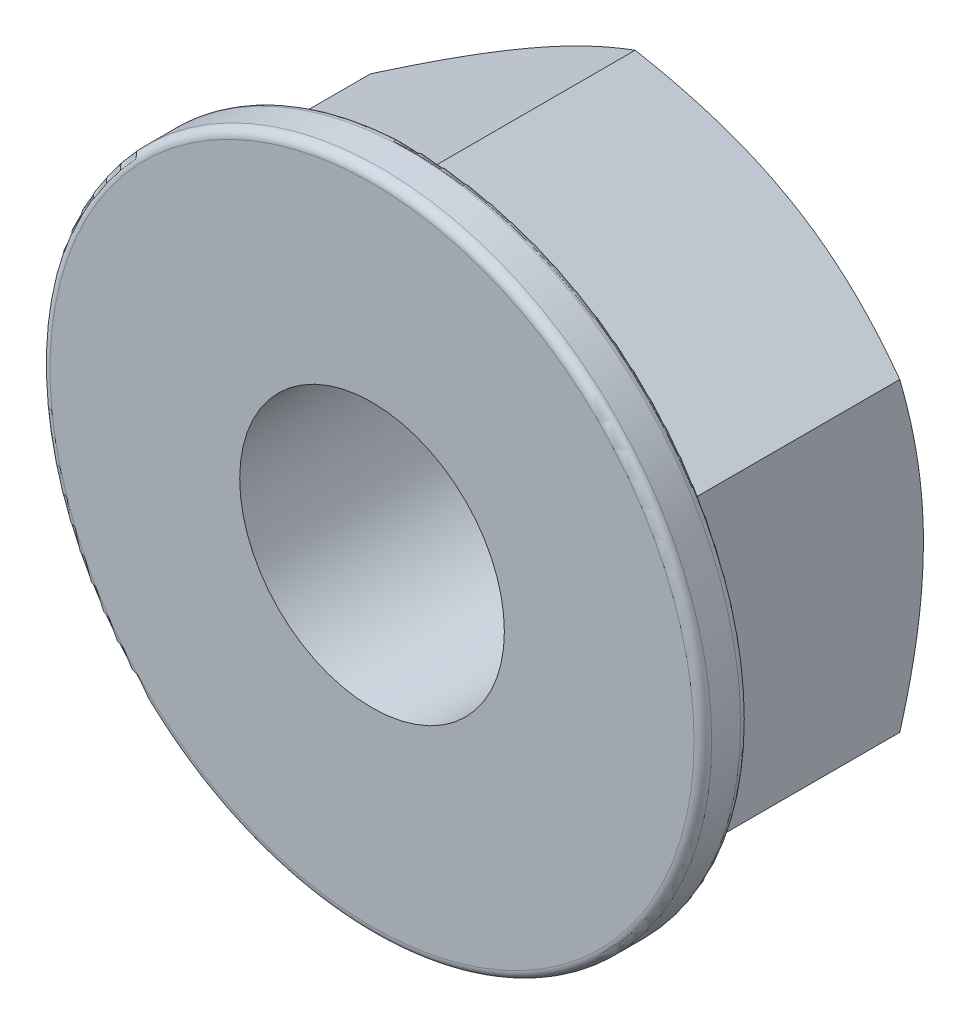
ISO-10303-21;
HEADER;
FILE_DESCRIPTION(('STEP AP214'),'2;1');
FILE_NAME('part.step','',(''),(''),'','','');
FILE_SCHEMA(('AUTOMOTIVE_DESIGN { 1 0 10303 214 1 1 1 1 }'));
ENDSEC;
DATA;
#1=APPLICATION_CONTEXT('core data for automotive mechanical design processes');
#2=APPLICATION_PROTOCOL_DEFINITION('international standard','automotive_design',2000,#1);
#3=PRODUCT_CONTEXT('',#1,'mechanical');
#4=PRODUCT('Part','Part','',(#3));
#5=PRODUCT_RELATED_PRODUCT_CATEGORY('part','',(#4));
#6=PRODUCT_DEFINITION_FORMATION('','',#4);
#7=PRODUCT_DEFINITION_CONTEXT('part definition',#1,'design');
#8=PRODUCT_DEFINITION('design','',#6,#7);
#9=PRODUCT_DEFINITION_SHAPE('','',#8);
#10=(LENGTH_UNIT() NAMED_UNIT(*) SI_UNIT(.MILLI.,.METRE.));
#11=(NAMED_UNIT(*) PLANE_ANGLE_UNIT() SI_UNIT($,.RADIAN.));
#12=(NAMED_UNIT(*) SI_UNIT($,.STERADIAN.) SOLID_ANGLE_UNIT());
#13=UNCERTAINTY_MEASURE_WITH_UNIT(LENGTH_MEASURE(1.E-05),#10,'distance_accuracy_value','');
#14=(GEOMETRIC_REPRESENTATION_CONTEXT(3) GLOBAL_UNCERTAINTY_ASSIGNED_CONTEXT((#13)) GLOBAL_UNIT_ASSIGNED_CONTEXT((#10,
#11,#12)) REPRESENTATION_CONTEXT('',''));
#15=CARTESIAN_POINT('',(0.,0.,0.));
#16=DIRECTION('',(0.,0.,1.));
#17=DIRECTION('',(1.,0.,0.));
#18=AXIS2_PLACEMENT_3D('',#15,#16,#17);
#19=CARTESIAN_POINT('',(3.,1.73205080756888,-3.25));
#20=DIRECTION('',(0.499999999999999,0.866025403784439,0.));
#21=DIRECTION('',(-0.866025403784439,0.5,0.));
#22=AXIS2_PLACEMENT_3D('',#19,#20,#21);
#23=PLANE('',#22);
#24=DIRECTION('',(0.,0.,1.));
#25=VECTOR('',#24,1.);
#26=CARTESIAN_POINT('',(0.,3.46410161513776,-3.25));
#27=LINE('',#26,#25);
#28=CARTESIAN_POINT('',(0.,3.46410161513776,-2.98205080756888));
#29=VERTEX_POINT('',#28);
#30=CARTESIAN_POINT('',(0.,3.46410161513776,-0.595299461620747));
#31=VERTEX_POINT('',#30);
#32=EDGE_CURVE('E125',#29,#31,#27,.T.);
#33=ORIENTED_EDGE('',*,*,#32,.T.);
#34=CARTESIAN_POINT('',(-0.0002,3.4642170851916,-0.595260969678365));
#35=CARTESIAN_POINT('',(0.124174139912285,3.39240964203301,-0.619207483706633));
#36=CARTESIAN_POINT('',(0.248894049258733,3.32040256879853,-0.640975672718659));
#37=CARTESIAN_POINT('',(0.499014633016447,3.17599538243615,-0.679254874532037));
#38=CARTESIAN_POINT('',(0.624415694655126,3.10359504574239,-0.695762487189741));
#39=CARTESIAN_POINT('',(0.874727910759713,2.95907722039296,-0.722480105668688));
#40=CARTESIAN_POINT('',(0.999635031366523,2.88696206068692,-0.732739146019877));
#41=CARTESIAN_POINT('',(1.24969482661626,2.74258997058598,-0.746498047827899));
#42=CARTESIAN_POINT('',(1.37484741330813,2.67033309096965,-0.749999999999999));
#43=CARTESIAN_POINT('',(1.62515258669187,2.52581933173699,-0.749999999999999));
#44=CARTESIAN_POINT('',(1.75030517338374,2.45356245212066,-0.746498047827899));
#45=CARTESIAN_POINT('',(2.00036496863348,2.30919036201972,-0.732739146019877));
#46=CARTESIAN_POINT('',(2.12527208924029,2.23707520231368,-0.722480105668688));
#47=CARTESIAN_POINT('',(2.37558430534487,2.09255737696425,-0.695762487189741));
#48=CARTESIAN_POINT('',(2.50098536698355,2.02015704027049,-0.679254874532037));
#49=CARTESIAN_POINT('',(2.75110595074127,1.87574985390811,-0.640975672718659));
#50=CARTESIAN_POINT('',(2.87582586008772,1.80374278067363,-0.619207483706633));
#51=CARTESIAN_POINT('',(3.0002,1.73193533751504,-0.595260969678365));
#52=B_SPLINE_CURVE_WITH_KNOTS('',3,(#34,#35,#36,#37,#38,#39,#40,#41,#42,#43,#44,#45,#46,#47,#48,
#49,#50,#51),.UNSPECIFIED.,.F.,.F.,(4,2,2,2,2,2,2,2,4),(0.,0.43682988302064,0.873941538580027,
1.30757729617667,1.74107886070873,2.17458042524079,2.60821618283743,3.04532783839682,
3.48215772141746),.UNSPECIFIED.);
#53=CARTESIAN_POINT('',(3.,1.73205080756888,-0.595299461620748));
#54=VERTEX_POINT('',#53);
#55=EDGE_CURVE('E45',#31,#54,#52,.T.);
#56=ORIENTED_EDGE('',*,*,#55,.T.);
#57=DIRECTION('',(0.,0.,1.));
#58=VECTOR('',#57,1.);
#59=CARTESIAN_POINT('',(3.,1.73205080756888,-3.25));
#60=LINE('',#59,#58);
#61=CARTESIAN_POINT('',(3.,1.73205080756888,-2.98205080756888));
#62=VERTEX_POINT('',#61);
#63=EDGE_CURVE('E140',#62,#54,#60,.T.);
#64=ORIENTED_EDGE('',*,*,#63,.F.);
#65=CARTESIAN_POINT('',(-0.0002,3.4642170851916,-2.98198413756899));
#66=CARTESIAN_POINT('',(0.131635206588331,3.38810199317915,-3.02594629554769));
#67=CARTESIAN_POINT('',(0.264608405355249,3.31132988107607,-3.06592841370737));
#68=CARTESIAN_POINT('',(0.532857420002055,3.15645624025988,-3.13571791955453));
#69=CARTESIAN_POINT('',(0.668138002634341,3.078351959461,-3.16550061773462));
#70=CARTESIAN_POINT('',(0.937022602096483,2.92311136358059,-3.21186216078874));
#71=CARTESIAN_POINT('',(1.07058524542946,2.84599893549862,-3.22874955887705));
#72=CARTESIAN_POINT('',(1.33833905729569,2.6914112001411,-3.24891035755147));
#73=CARTESIAN_POINT('',(1.47252925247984,2.61393645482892,-3.25220045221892));
#74=CARTESIAN_POINT('',(1.72327559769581,2.46916798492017,-3.24535946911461));
#75=CARTESIAN_POINT('',(1.83986926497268,2.40185259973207,-3.23690808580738));
#76=CARTESIAN_POINT('',(2.07229698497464,2.2676603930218,-3.21012105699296));
#77=CARTESIAN_POINT('',(2.18813023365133,2.2007840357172,-3.19177625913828));
#78=CARTESIAN_POINT('',(2.42103725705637,2.06631510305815,-3.14591524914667));
#79=CARTESIAN_POINT('',(2.53808155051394,1.99873954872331,-3.11820461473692));
#80=CARTESIAN_POINT('',(2.77042435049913,1.8645963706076,-3.0553122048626));
#81=CARTESIAN_POINT('',(2.88572583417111,1.79802702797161,-3.02014520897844));
#82=CARTESIAN_POINT('',(3.0002,1.73193533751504,-2.98198413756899));
#83=B_SPLINE_CURVE_WITH_KNOTS('',3,(#65,#66,#67,#68,#69,#70,#71,#72,#73,#74,#75,#76,#77,#78,#79,
#80,#81,#82),.UNSPECIFIED.,.F.,.F.,(4,2,2,2,2,2,2,2,4),(0.,0.47553983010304,0.952222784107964,
1.41710776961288,1.88142182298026,2.28572436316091,2.69040156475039,3.10405572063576,
3.5168974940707),.UNSPECIFIED.);
#84=CARTESIAN_POINT('',(1.5,2.59807621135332,-3.25));
#85=VERTEX_POINT('',#84);
#86=EDGE_CURVE('E153',#85,#62,#83,.T.);
#87=ORIENTED_EDGE('',*,*,#86,.F.);
#88=EDGE_CURVE('E129',#29,#85,#83,.T.);
#89=ORIENTED_EDGE('',*,*,#88,.F.);
#90=EDGE_LOOP('',(#33,#56,#64,#87,#89));
#91=FACE_BOUND('',#90,.T.);
#92=ADVANCED_FACE('F26',(#91),#23,.T.);
#93=CARTESIAN_POINT('',(3.,-1.73205080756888,-3.25));
#94=DIRECTION('',(1.,0.,0.));
#95=DIRECTION('',(0.,0.,-1.));
#96=AXIS2_PLACEMENT_3D('',#93,#94,#95);
#97=PLANE('',#96);
#98=ORIENTED_EDGE('',*,*,#63,.T.);
#99=CARTESIAN_POINT('',(3.,-4.59020119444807,0.0778690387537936));
#100=CARTESIAN_POINT('',(3.,-4.45420228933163,0.0399323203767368));
#101=CARTESIAN_POINT('',(3.,-4.31807581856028,0.00244462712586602));
#102=CARTESIAN_POINT('',(3.,-4.04550363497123,-0.0713861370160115));
#103=CARTESIAN_POINT('',(3.,-3.90905790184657,-0.107729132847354));
#104=CARTESIAN_POINT('',(3.,-3.63559336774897,-0.179073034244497));
#105=CARTESIAN_POINT('',(3.,-3.49857401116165,-0.214071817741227));
#106=CARTESIAN_POINT('',(3.,-3.22410320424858,-0.282330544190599));
#107=CARTESIAN_POINT('',(3.,-3.08665175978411,-0.315590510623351));
#108=CARTESIAN_POINT('',(3.,-2.81286518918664,-0.379566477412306));
#109=CARTESIAN_POINT('',(3.,-2.67653602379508,-0.410307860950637));
#110=CARTESIAN_POINT('',(3.,-2.40331140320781,-0.469156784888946));
#111=CARTESIAN_POINT('',(3.,-2.26641596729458,-0.497264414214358));
#112=CARTESIAN_POINT('',(3.,-1.99201717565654,-0.550202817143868));
#113=CARTESIAN_POINT('',(3.,-1.85451395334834,-0.575034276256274));
#114=CARTESIAN_POINT('',(3.,-1.57883140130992,-0.620673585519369));
#115=CARTESIAN_POINT('',(3.,-1.4406520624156,-0.641481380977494));
#116=CARTESIAN_POINT('',(3.,-1.16736289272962,-0.677750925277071));
#117=CARTESIAN_POINT('',(3.,-1.03227036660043,-0.69334131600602));
#118=CARTESIAN_POINT('',(3.,-0.761584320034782,-0.719185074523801));
#119=CARTESIAN_POINT('',(3.,-0.625990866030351,-0.729439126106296));
#120=CARTESIAN_POINT('',(3.,-0.354569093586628,-0.74402859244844));
#121=CARTESIAN_POINT('',(3.,-0.218740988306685,-0.748367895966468));
#122=CARTESIAN_POINT('',(3.,0.0529727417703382,-0.750868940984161));
#123=CARTESIAN_POINT('',(3.,0.188858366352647,-0.749030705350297));
#124=CARTESIAN_POINT('',(3.,0.461110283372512,-0.739268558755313));
#125=CARTESIAN_POINT('',(3.,0.597475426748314,-0.731313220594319));
#126=CARTESIAN_POINT('',(3.,0.869754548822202,-0.709755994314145));
#127=CARTESIAN_POINT('',(3.,1.0056685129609,-0.696153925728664));
#128=CARTESIAN_POINT('',(3.,1.27703363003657,-0.663993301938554));
#129=CARTESIAN_POINT('',(3.,1.4124842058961,-0.645429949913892));
#130=CARTESIAN_POINT('',(3.,1.68273907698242,-0.604127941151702));
#131=CARTESIAN_POINT('',(3.,1.81754336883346,-0.581389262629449));
#132=CARTESIAN_POINT('',(3.,2.21204103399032,-0.509685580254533));
#133=CARTESIAN_POINT('',(3.,2.47088128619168,-0.456048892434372));
#134=CARTESIAN_POINT('',(3.,2.98667363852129,-0.340354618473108));
#135=CARTESIAN_POINT('',(3.,3.24362531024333,-0.278295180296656));
#136=CARTESIAN_POINT('',(3.,3.75623603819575,-0.148558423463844));
#137=CARTESIAN_POINT('',(3.,4.01189435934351,-0.0808782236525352));
#138=CARTESIAN_POINT('',(3.,4.5221438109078,0.0582624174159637));
#139=CARTESIAN_POINT('',(3.,4.7767350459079,0.129722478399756));
#140=CARTESIAN_POINT('',(3.,5.28177573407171,0.274315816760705));
#141=CARTESIAN_POINT('',(3.,5.53223522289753,0.347414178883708));
#142=CARTESIAN_POINT('',(3.,6.03261138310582,0.495468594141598));
#143=CARTESIAN_POINT('',(3.,6.28252803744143,0.570424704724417));
#144=CARTESIAN_POINT('',(3.,6.78140909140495,0.721541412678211));
#145=CARTESIAN_POINT('',(3.,7.03037438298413,0.797699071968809));
#146=CARTESIAN_POINT('',(3.,7.52796786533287,0.951060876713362));
#147=CARTESIAN_POINT('',(3.,7.77659607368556,1.02826496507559));
#148=CARTESIAN_POINT('',(3.,8.02510735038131,1.10583900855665));
#149=B_SPLINE_CURVE_WITH_KNOTS('',3,(#99,#100,#101,#102,#103,#104,#105,#106,#107,#108,#109,#110,
#111,#112,#113,#114,#115,#116,#117,#118,#119,#120,#121,#122,#123,#124,#125,#126,#127,#128,#129,
#130,#131,#132,#133,#134,#135,#136,#137,#138,#139,#140,#141,#142,#143,#144,#145,#146,#147,#148),
.UNSPECIFIED.,.F.,.F.,(4,2,2,2,2,2,2,2,2,2,2,2,2,2,2,2,2,2,2,2,2,2,2,2,4),(0.,0.42357554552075,
0.847178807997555,1.27142540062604,1.69566626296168,2.11490216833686,2.53412391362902,
2.9532578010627,3.37239738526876,3.78027302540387,4.188096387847,4.59565148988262,
5.00320508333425,5.41286662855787,5.82254126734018,6.23261344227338,6.64268775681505,
7.43545521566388,8.22839727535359,9.02174832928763,9.81501971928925,10.5977359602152,
11.3804764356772,12.1615330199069,12.9425471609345),.UNSPECIFIED.);
#150=CARTESIAN_POINT('',(3.,-1.73205080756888,-0.595299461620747));
#151=VERTEX_POINT('',#150);
#152=EDGE_CURVE('E172',#54,#151,#149,.F.);
#153=ORIENTED_EDGE('',*,*,#152,.T.);
#154=DIRECTION('',(0.,0.,1.));
#155=VECTOR('',#154,1.);
#156=CARTESIAN_POINT('',(3.,-1.73205080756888,-3.25));
#157=LINE('',#156,#155);
#158=CARTESIAN_POINT('',(3.,-1.73205080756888,-2.98205080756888));
#159=VERTEX_POINT('',#158);
#160=EDGE_CURVE('E145',#159,#151,#157,.T.);
#161=ORIENTED_EDGE('',*,*,#160,.F.);
#162=CARTESIAN_POINT('',(3.,-4.66961520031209,-1.77761086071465));
#163=CARTESIAN_POINT('',(3.,-4.53839997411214,-1.84133063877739));
#164=CARTESIAN_POINT('',(3.,-4.40688527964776,-1.90444421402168));
#165=CARTESIAN_POINT('',(3.,-4.14309768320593,-2.02911821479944));
#166=CARTESIAN_POINT('',(3.,-4.01082466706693,-2.09067839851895));
#167=CARTESIAN_POINT('',(3.,-3.74468832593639,-2.21221069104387));
#168=CARTESIAN_POINT('',(3.,-3.61082027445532,-2.27217248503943));
#169=CARTESIAN_POINT('',(3.,-3.3420249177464,-2.38966369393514));
#170=CARTESIAN_POINT('',(3.,-3.20709766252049,-2.44719322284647));
#171=CARTESIAN_POINT('',(3.,-2.93163396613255,-2.56096864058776));
#172=CARTESIAN_POINT('',(3.,-2.79105608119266,-2.6171147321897));
#173=CARTESIAN_POINT('',(3.,-2.50826222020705,-2.72519882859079));
#174=CARTESIAN_POINT('',(3.,-2.36604606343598,-2.77713636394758));
#175=CARTESIAN_POINT('',(3.,-2.08000969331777,-2.87545307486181));
#176=CARTESIAN_POINT('',(3.,-1.936193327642,-2.92184333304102));
#177=CARTESIAN_POINT('',(3.,-1.64649812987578,-3.00758861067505));
#178=CARTESIAN_POINT('',(3.,-1.50061995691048,-3.04694582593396));
#179=CARTESIAN_POINT('',(3.,-1.20748793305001,-3.11654848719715));
#180=CARTESIAN_POINT('',(3.,-1.06024555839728,-3.14684137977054));
#181=CARTESIAN_POINT('',(3.,-0.763912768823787,-3.19659944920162));
#182=CARTESIAN_POINT('',(3.,-0.614822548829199,-3.21606575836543));
#183=CARTESIAN_POINT('',(3.,-0.317492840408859,-3.24236390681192));
#184=CARTESIAN_POINT('',(3.,-0.16926820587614,-3.24935954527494));
#185=CARTESIAN_POINT('',(3.,0.12724792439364,-3.25055550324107));
#186=CARTESIAN_POINT('',(3.,0.275539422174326,-3.2447554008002));
#187=CARTESIAN_POINT('',(3.,0.526718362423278,-3.22450560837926));
#188=CARTESIAN_POINT('',(3.,0.629872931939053,-3.21317498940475));
#189=CARTESIAN_POINT('',(3.,0.835434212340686,-3.1850174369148));
#190=CARTESIAN_POINT('',(3.,0.937840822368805,-3.1681897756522));
#191=CARTESIAN_POINT('',(3.,1.24379191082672,-3.11034516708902));
#192=CARTESIAN_POINT('',(3.,1.44596225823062,-3.06197622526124));
#193=CARTESIAN_POINT('',(3.,1.74842393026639,-2.97797843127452));
#194=CARTESIAN_POINT('',(3.,1.85027756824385,-2.94765443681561));
#195=CARTESIAN_POINT('',(3.,2.05299487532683,-2.8838315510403));
#196=CARTESIAN_POINT('',(3.,2.15385853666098,-2.85033263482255));
#197=CARTESIAN_POINT('',(3.,2.3546297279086,-2.78069976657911));
#198=CARTESIAN_POINT('',(3.,2.45453753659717,-2.74456661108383));
#199=CARTESIAN_POINT('',(3.,2.65352144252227,-2.67009304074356));
#200=CARTESIAN_POINT('',(3.,2.75259756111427,-2.63175268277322));
#201=CARTESIAN_POINT('',(3.,3.02983879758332,-2.52148714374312));
#202=CARTESIAN_POINT('',(3.,3.20717304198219,-2.4474745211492));
#203=CARTESIAN_POINT('',(3.,3.55995594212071,-2.29506810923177));
#204=CARTESIAN_POINT('',(3.,3.73540436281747,-2.21667378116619));
#205=CARTESIAN_POINT('',(3.,4.08486964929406,-2.05659644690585));
#206=CARTESIAN_POINT('',(3.,4.25888594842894,-1.97491220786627));
#207=CARTESIAN_POINT('',(3.,4.60573898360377,-1.80907141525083));
#208=CARTESIAN_POINT('',(3.,4.77857568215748,-1.72491478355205));
#209=CARTESIAN_POINT('',(3.,5.12358964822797,-1.55455574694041));
#210=CARTESIAN_POINT('',(3.,5.29576536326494,-1.46835020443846));
#211=CARTESIAN_POINT('',(3.,5.63935614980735,-1.2944348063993));
#212=CARTESIAN_POINT('',(3.,5.81077121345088,-1.20672493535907));
#213=CARTESIAN_POINT('',(3.,6.32401410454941,-0.941858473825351));
#214=CARTESIAN_POINT('',(3.,6.66492352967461,-0.76292320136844));
#215=CARTESIAN_POINT('',(3.,7.3069721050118,-0.422157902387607));
#216=CARTESIAN_POINT('',(3.,7.60828723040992,-0.26065786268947));
#217=CARTESIAN_POINT('',(3.,8.209970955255,0.0641436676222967));
#218=CARTESIAN_POINT('',(3.,8.51033948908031,0.227445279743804));
#219=CARTESIAN_POINT('',(3.,9.10932825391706,0.554812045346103));
#220=CARTESIAN_POINT('',(3.,9.40795095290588,0.718872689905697));
#221=CARTESIAN_POINT('',(3.,10.0046079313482,1.04800238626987));
#222=CARTESIAN_POINT('',(3.,10.3026422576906,1.21307135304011));
#223=CARTESIAN_POINT('',(3.,10.6004726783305,1.37850527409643));
#224=B_SPLINE_CURVE_WITH_KNOTS('',3,(#162,#163,#164,#165,#166,#167,#168,#169,#170,#171,#172,
#173,#174,#175,#176,#177,#178,#179,#180,#181,#182,#183,#184,#185,#186,#187,#188,#189,#190,#191,
#192,#193,#194,#195,#196,#197,#198,#199,#200,#201,#202,#203,#204,#205,#206,#207,#208,#209,#210,
#211,#212,#213,#214,#215,#216,#217,#218,#219,#220,#221,#222,#223),.UNSPECIFIED.,.F.,.F.,(4,2,2,
2,2,2,2,2,2,2,2,2,2,2,2,2,2,2,2,2,2,2,2,2,2,2,2,2,2,2,4),(0.,0.437611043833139,
0.875289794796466,1.31532114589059,1.75533184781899,2.20940609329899,2.66353091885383,
3.1167327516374,3.56979284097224,4.02043817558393,4.47103637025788,4.91567120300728,
5.36032069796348,5.67149523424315,5.9827109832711,6.60545852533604,6.92424658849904,
7.24303715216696,7.56173171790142,7.88041807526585,8.4568056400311,9.03326422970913,
9.60994088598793,10.1866357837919,10.7642793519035,11.3419288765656,12.4969467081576,
13.5225417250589,14.5482063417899,15.5703699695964,16.5924485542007),.UNSPECIFIED.);
#225=CARTESIAN_POINT('',(3.,0.,-3.25));
#226=VERTEX_POINT('',#225);
#227=EDGE_CURVE('E217',#226,#159,#224,.F.);
#228=ORIENTED_EDGE('',*,*,#227,.F.);
#229=EDGE_CURVE('E222',#62,#226,#224,.F.);
#230=ORIENTED_EDGE('',*,*,#229,.F.);
#231=EDGE_LOOP('',(#98,#153,#161,#228,#230));
#232=FACE_BOUND('',#231,.T.);
#233=ADVANCED_FACE('F209',(#232),#97,.T.);
#234=CARTESIAN_POINT('',(3.,-1.73205080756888,-3.25));
#235=DIRECTION('',(0.499999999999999,-0.866025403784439,0.));
#236=DIRECTION('',(0.866025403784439,0.5,0.));
#237=AXIS2_PLACEMENT_3D('',#234,#235,#236);
#238=PLANE('',#237);
#239=ORIENTED_EDGE('',*,*,#160,.T.);
#240=CARTESIAN_POINT('',(3.0002,-1.73193533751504,-0.595260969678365));
#241=CARTESIAN_POINT('',(2.87582586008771,-1.80374278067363,-0.619207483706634));
#242=CARTESIAN_POINT('',(2.75110595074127,-1.87574985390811,-0.640975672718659));
#243=CARTESIAN_POINT('',(2.50098536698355,-2.02015704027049,-0.679254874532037));
#244=CARTESIAN_POINT('',(2.37558430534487,-2.09255737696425,-0.695762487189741));
#245=CARTESIAN_POINT('',(2.12527208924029,-2.23707520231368,-0.722480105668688));
#246=CARTESIAN_POINT('',(2.00036496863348,-2.30919036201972,-0.732739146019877));
#247=CARTESIAN_POINT('',(1.75030517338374,-2.45356245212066,-0.746498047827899));
#248=CARTESIAN_POINT('',(1.62515258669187,-2.52581933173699,-0.749999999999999));
#249=CARTESIAN_POINT('',(1.37484741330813,-2.67033309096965,-0.749999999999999));
#250=CARTESIAN_POINT('',(1.24969482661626,-2.74258997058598,-0.746498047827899));
#251=CARTESIAN_POINT('',(0.999635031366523,-2.88696206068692,-0.732739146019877));
#252=CARTESIAN_POINT('',(0.874727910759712,-2.95907722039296,-0.722480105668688));
#253=CARTESIAN_POINT('',(0.624415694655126,-3.10359504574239,-0.695762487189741));
#254=CARTESIAN_POINT('',(0.499014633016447,-3.17599538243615,-0.679254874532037));
#255=CARTESIAN_POINT('',(0.248894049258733,-3.32040256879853,-0.640975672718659));
#256=CARTESIAN_POINT('',(0.124174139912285,-3.39240964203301,-0.619207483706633));
#257=CARTESIAN_POINT('',(-0.00020000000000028,-3.4642170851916,-0.595260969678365));
#258=B_SPLINE_CURVE_WITH_KNOTS('',3,(#240,#241,#242,#243,#244,#245,#246,#247,#248,#249,#250,
#251,#252,#253,#254,#255,#256,#257),.UNSPECIFIED.,.F.,.F.,(4,2,2,2,2,2,2,2,4),(0.,
0.43682988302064,0.873941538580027,1.30757729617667,1.74107886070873,2.17458042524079,
2.60821618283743,3.04532783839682,3.48215772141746),.UNSPECIFIED.);
#259=CARTESIAN_POINT('',(0.,-3.46410161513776,-0.595299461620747));
#260=VERTEX_POINT('',#259);
#261=EDGE_CURVE('E170',#151,#260,#258,.T.);
#262=ORIENTED_EDGE('',*,*,#261,.T.);
#263=DIRECTION('',(0.,0.,1.));
#264=VECTOR('',#263,1.);
#265=CARTESIAN_POINT('',(0.,-3.46410161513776,-3.25));
#266=LINE('',#265,#264);
#267=CARTESIAN_POINT('',(0.,-3.46410161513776,-2.98205080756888));
#268=VERTEX_POINT('',#267);
#269=EDGE_CURVE('E127',#268,#260,#266,.T.);
#270=ORIENTED_EDGE('',*,*,#269,.F.);
#271=CARTESIAN_POINT('',(3.0002,-1.73193533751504,-2.98198413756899));
#272=CARTESIAN_POINT('',(2.86836479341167,-1.80805042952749,-3.02594629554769));
#273=CARTESIAN_POINT('',(2.73539159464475,-1.88482254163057,-3.06592841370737));
#274=CARTESIAN_POINT('',(2.46714257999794,-2.03969618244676,-3.13571791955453));
#275=CARTESIAN_POINT('',(2.33186199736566,-2.11780046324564,-3.16550061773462));
#276=CARTESIAN_POINT('',(2.06297739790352,-2.27304105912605,-3.21186216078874));
#277=CARTESIAN_POINT('',(1.92941475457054,-2.35015348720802,-3.22874955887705));
#278=CARTESIAN_POINT('',(1.66166094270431,-2.50474122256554,-3.24891035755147));
#279=CARTESIAN_POINT('',(1.52747074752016,-2.58221596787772,-3.25220045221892));
#280=CARTESIAN_POINT('',(1.27672440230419,-2.72698443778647,-3.24535946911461));
#281=CARTESIAN_POINT('',(1.16013073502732,-2.79429982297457,-3.23690808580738));
#282=CARTESIAN_POINT('',(0.927703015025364,-2.92849202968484,-3.21012105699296));
#283=CARTESIAN_POINT('',(0.811869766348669,-2.99536838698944,-3.19177625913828));
#284=CARTESIAN_POINT('',(0.578962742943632,-3.12983731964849,-3.14591524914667));
#285=CARTESIAN_POINT('',(0.461918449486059,-3.19741287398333,-3.11820461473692));
#286=CARTESIAN_POINT('',(0.229575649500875,-3.33155605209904,-3.0553122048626));
#287=CARTESIAN_POINT('',(0.114274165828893,-3.39812539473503,-3.02014520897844));
#288=CARTESIAN_POINT('',(-0.000200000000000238,-3.4642170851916,-2.98198413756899));
#289=B_SPLINE_CURVE_WITH_KNOTS('',3,(#271,#272,#273,#274,#275,#276,#277,#278,#279,#280,#281,
#282,#283,#284,#285,#286,#287,#288),.UNSPECIFIED.,.F.,.F.,(4,2,2,2,2,2,2,2,4),(0.,
0.47553983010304,0.952222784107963,1.41710776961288,1.88142182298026,2.28572436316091,
2.69040156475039,3.10405572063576,3.5168974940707),.UNSPECIFIED.);
#290=CARTESIAN_POINT('',(1.5,-2.59807621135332,-3.25));
#291=VERTEX_POINT('',#290);
#292=EDGE_CURVE('E168',#291,#268,#289,.T.);
#293=ORIENTED_EDGE('',*,*,#292,.F.);
#294=EDGE_CURVE('E223',#159,#291,#289,.T.);
#295=ORIENTED_EDGE('',*,*,#294,.F.);
#296=EDGE_LOOP('',(#239,#262,#270,#293,#295));
#297=FACE_BOUND('',#296,.T.);
#298=ADVANCED_FACE('F166',(#297),#238,.T.);
#299=CARTESIAN_POINT('',(-3.,-1.73205080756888,-3.25));
#300=DIRECTION('',(-0.499999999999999,-0.866025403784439,0.));
#301=DIRECTION('',(0.866025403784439,-0.5,0.));
#302=AXIS2_PLACEMENT_3D('',#299,#300,#301);
#303=PLANE('',#302);
#304=ORIENTED_EDGE('',*,*,#269,.T.);
#305=CARTESIAN_POINT('',(0.0002,-3.4642170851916,-0.595260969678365));
#306=CARTESIAN_POINT('',(-0.124174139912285,-3.39240964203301,-0.619207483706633));
#307=CARTESIAN_POINT('',(-0.248894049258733,-3.32040256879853,-0.640975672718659));
#308=CARTESIAN_POINT('',(-0.499014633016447,-3.17599538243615,-0.679254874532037));
#309=CARTESIAN_POINT('',(-0.624415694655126,-3.10359504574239,-0.695762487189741));
#310=CARTESIAN_POINT('',(-0.874727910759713,-2.95907722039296,-0.722480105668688));
#311=CARTESIAN_POINT('',(-0.999635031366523,-2.88696206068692,-0.732739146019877));
#312=CARTESIAN_POINT('',(-1.24969482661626,-2.74258997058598,-0.746498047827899));
#313=CARTESIAN_POINT('',(-1.37484741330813,-2.67033309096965,-0.749999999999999));
#314=CARTESIAN_POINT('',(-1.62515258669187,-2.52581933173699,-0.749999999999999));
#315=CARTESIAN_POINT('',(-1.75030517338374,-2.45356245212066,-0.746498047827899));
#316=CARTESIAN_POINT('',(-2.00036496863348,-2.30919036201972,-0.732739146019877));
#317=CARTESIAN_POINT('',(-2.12527208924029,-2.23707520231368,-0.722480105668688));
#318=CARTESIAN_POINT('',(-2.37558430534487,-2.09255737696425,-0.695762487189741));
#319=CARTESIAN_POINT('',(-2.50098536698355,-2.02015704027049,-0.679254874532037));
#320=CARTESIAN_POINT('',(-2.75110595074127,-1.87574985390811,-0.640975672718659));
#321=CARTESIAN_POINT('',(-2.87582586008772,-1.80374278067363,-0.619207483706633));
#322=CARTESIAN_POINT('',(-3.0002,-1.73193533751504,-0.595260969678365));
#323=B_SPLINE_CURVE_WITH_KNOTS('',3,(#305,#306,#307,#308,#309,#310,#311,#312,#313,#314,#315,
#316,#317,#318,#319,#320,#321,#322),.UNSPECIFIED.,.F.,.F.,(4,2,2,2,2,2,2,2,4),(0.,
0.43682988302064,0.873941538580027,1.30757729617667,1.74107886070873,2.17458042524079,
2.60821618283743,3.04532783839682,3.48215772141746),.UNSPECIFIED.);
#324=CARTESIAN_POINT('',(-3.,-1.73205080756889,-0.595299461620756));
#325=VERTEX_POINT('',#324);
#326=EDGE_CURVE('E112',#260,#325,#323,.T.);
#327=ORIENTED_EDGE('',*,*,#326,.T.);
#328=DIRECTION('',(0.,0.,1.));
#329=VECTOR('',#328,1.);
#330=CARTESIAN_POINT('',(-3.,-1.73205080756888,-3.25));
#331=LINE('',#330,#329);
#332=CARTESIAN_POINT('',(-3.,-1.73205080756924,-2.98205080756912));
#333=VERTEX_POINT('',#332);
#334=EDGE_CURVE('E110',#333,#325,#331,.T.);
#335=ORIENTED_EDGE('',*,*,#334,.F.);
#336=CARTESIAN_POINT('',(0.0002,-3.4642170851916,-2.98198413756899));
#337=CARTESIAN_POINT('',(-0.131635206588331,-3.38810199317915,-3.02594629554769));
#338=CARTESIAN_POINT('',(-0.264608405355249,-3.31132988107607,-3.06592841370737));
#339=CARTESIAN_POINT('',(-0.532857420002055,-3.15645624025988,-3.13571791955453));
#340=CARTESIAN_POINT('',(-0.668138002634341,-3.078351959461,-3.16550061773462));
#341=CARTESIAN_POINT('',(-0.937022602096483,-2.92311136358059,-3.21186216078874));
#342=CARTESIAN_POINT('',(-1.07058524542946,-2.84599893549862,-3.22874955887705));
#343=CARTESIAN_POINT('',(-1.33833905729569,-2.6914112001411,-3.24891035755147));
#344=CARTESIAN_POINT('',(-1.47252925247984,-2.61393645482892,-3.25220045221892));
#345=CARTESIAN_POINT('',(-1.72327559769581,-2.46916798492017,-3.24535946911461));
#346=CARTESIAN_POINT('',(-1.83986926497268,-2.40185259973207,-3.23690808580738));
#347=CARTESIAN_POINT('',(-2.07229698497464,-2.2676603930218,-3.21012105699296));
#348=CARTESIAN_POINT('',(-2.18813023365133,-2.2007840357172,-3.19177625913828));
#349=CARTESIAN_POINT('',(-2.42103725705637,-2.06631510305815,-3.14591524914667));
#350=CARTESIAN_POINT('',(-2.53808155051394,-1.99873954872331,-3.11820461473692));
#351=CARTESIAN_POINT('',(-2.77042435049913,-1.8645963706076,-3.0553122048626));
#352=CARTESIAN_POINT('',(-2.88572583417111,-1.79802702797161,-3.02014520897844));
#353=CARTESIAN_POINT('',(-3.0002,-1.73193533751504,-2.98198413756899));
#354=B_SPLINE_CURVE_WITH_KNOTS('',3,(#336,#337,#338,#339,#340,#341,#342,#343,#344,#345,#346,
#347,#348,#349,#350,#351,#352,#353),.UNSPECIFIED.,.F.,.F.,(4,2,2,2,2,2,2,2,4),(0.,
0.47553983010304,0.952222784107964,1.41710776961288,1.88142182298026,2.28572436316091,
2.69040156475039,3.10405572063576,3.5168974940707),.UNSPECIFIED.);
#355=CARTESIAN_POINT('',(-1.5,-2.59807621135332,-3.25));
#356=VERTEX_POINT('',#355);
#357=EDGE_CURVE('E254',#356,#333,#354,.T.);
#358=ORIENTED_EDGE('',*,*,#357,.F.);
#359=EDGE_CURVE('E52',#268,#356,#354,.T.);
#360=ORIENTED_EDGE('',*,*,#359,.F.);
#361=EDGE_LOOP('',(#304,#327,#335,#358,#360));
#362=FACE_BOUND('',#361,.T.);
#363=ADVANCED_FACE('F162',(#362),#303,.T.);
#364=CARTESIAN_POINT('',(-3.,-1.73205080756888,-3.25));
#365=DIRECTION('',(-1.,0.,0.));
#366=DIRECTION('',(0.,0.,1.));
#367=AXIS2_PLACEMENT_3D('',#364,#365,#366);
#368=PLANE('',#367);
#369=ORIENTED_EDGE('',*,*,#334,.T.);
#370=CARTESIAN_POINT('',(-3.,-4.59020119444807,0.0778690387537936));
#371=CARTESIAN_POINT('',(-3.,-4.45420228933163,0.0399323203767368));
#372=CARTESIAN_POINT('',(-3.,-4.31807581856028,0.00244462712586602));
#373=CARTESIAN_POINT('',(-3.,-4.04550363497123,-0.0713861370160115));
#374=CARTESIAN_POINT('',(-3.,-3.90905790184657,-0.107729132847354));
#375=CARTESIAN_POINT('',(-3.,-3.63559336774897,-0.179073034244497));
#376=CARTESIAN_POINT('',(-3.,-3.49857401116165,-0.214071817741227));
#377=CARTESIAN_POINT('',(-3.,-3.22410320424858,-0.282330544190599));
#378=CARTESIAN_POINT('',(-3.,-3.08665175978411,-0.315590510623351));
#379=CARTESIAN_POINT('',(-3.,-2.81286518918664,-0.379566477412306));
#380=CARTESIAN_POINT('',(-3.,-2.67653602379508,-0.410307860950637));
#381=CARTESIAN_POINT('',(-3.,-2.40331140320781,-0.469156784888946));
#382=CARTESIAN_POINT('',(-3.,-2.26641596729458,-0.497264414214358));
#383=CARTESIAN_POINT('',(-3.,-1.99201717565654,-0.550202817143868));
#384=CARTESIAN_POINT('',(-3.,-1.85451395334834,-0.575034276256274));
#385=CARTESIAN_POINT('',(-3.,-1.57883140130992,-0.620673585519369));
#386=CARTESIAN_POINT('',(-3.,-1.4406520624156,-0.641481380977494));
#387=CARTESIAN_POINT('',(-3.,-1.16736289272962,-0.677750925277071));
#388=CARTESIAN_POINT('',(-3.,-1.03227036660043,-0.69334131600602));
#389=CARTESIAN_POINT('',(-3.,-0.761584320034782,-0.719185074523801));
#390=CARTESIAN_POINT('',(-3.,-0.625990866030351,-0.729439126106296));
#391=CARTESIAN_POINT('',(-3.,-0.354569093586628,-0.74402859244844));
#392=CARTESIAN_POINT('',(-3.,-0.218740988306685,-0.748367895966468));
#393=CARTESIAN_POINT('',(-3.,0.0529727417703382,-0.750868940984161));
#394=CARTESIAN_POINT('',(-3.,0.188858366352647,-0.749030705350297));
#395=CARTESIAN_POINT('',(-3.,0.461110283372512,-0.739268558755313));
#396=CARTESIAN_POINT('',(-3.,0.597475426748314,-0.731313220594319));
#397=CARTESIAN_POINT('',(-3.,0.869754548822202,-0.709755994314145));
#398=CARTESIAN_POINT('',(-3.,1.0056685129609,-0.696153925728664));
#399=CARTESIAN_POINT('',(-3.,1.27703363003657,-0.663993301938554));
#400=CARTESIAN_POINT('',(-3.,1.4124842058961,-0.645429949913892));
#401=CARTESIAN_POINT('',(-3.,1.68273907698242,-0.604127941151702));
#402=CARTESIAN_POINT('',(-3.,1.81754336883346,-0.581389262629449));
#403=CARTESIAN_POINT('',(-3.,2.21204103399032,-0.509685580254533));
#404=CARTESIAN_POINT('',(-3.,2.47088128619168,-0.456048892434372));
#405=CARTESIAN_POINT('',(-3.,2.98667363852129,-0.340354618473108));
#406=CARTESIAN_POINT('',(-3.,3.24362531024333,-0.278295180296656));
#407=CARTESIAN_POINT('',(-3.,3.75623603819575,-0.148558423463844));
#408=CARTESIAN_POINT('',(-3.,4.01189435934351,-0.0808782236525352));
#409=CARTESIAN_POINT('',(-3.,4.5221438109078,0.0582624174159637));
#410=CARTESIAN_POINT('',(-3.,4.7767350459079,0.129722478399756));
#411=CARTESIAN_POINT('',(-3.,5.28177573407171,0.274315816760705));
#412=CARTESIAN_POINT('',(-3.,5.53223522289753,0.347414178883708));
#413=CARTESIAN_POINT('',(-3.,6.03261138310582,0.495468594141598));
#414=CARTESIAN_POINT('',(-3.,6.28252803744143,0.570424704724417));
#415=CARTESIAN_POINT('',(-3.,6.78140909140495,0.721541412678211));
#416=CARTESIAN_POINT('',(-3.,7.03037438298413,0.797699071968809));
#417=CARTESIAN_POINT('',(-3.,7.52796786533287,0.951060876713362));
#418=CARTESIAN_POINT('',(-3.,7.77659607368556,1.02826496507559));
#419=CARTESIAN_POINT('',(-3.,8.02510735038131,1.10583900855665));
#420=B_SPLINE_CURVE_WITH_KNOTS('',3,(#370,#371,#372,#373,#374,#375,#376,#377,#378,#379,#380,
#381,#382,#383,#384,#385,#386,#387,#388,#389,#390,#391,#392,#393,#394,#395,#396,#397,#398,#399,
#400,#401,#402,#403,#404,#405,#406,#407,#408,#409,#410,#411,#412,#413,#414,#415,#416,#417,#418,
#419),.UNSPECIFIED.,.F.,.F.,(4,2,2,2,2,2,2,2,2,2,2,2,2,2,2,2,2,2,2,2,2,2,2,2,4),(0.,
0.42357554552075,0.847178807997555,1.27142540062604,1.69566626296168,2.11490216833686,
2.53412391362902,2.9532578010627,3.37239738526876,3.78027302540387,4.188096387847,
4.59565148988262,5.00320508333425,5.41286662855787,5.82254126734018,6.23261344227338,
6.64268775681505,7.43545521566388,8.22839727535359,9.02174832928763,9.81501971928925,
10.5977359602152,11.3804764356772,12.1615330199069,12.9425471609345),.UNSPECIFIED.);
#421=CARTESIAN_POINT('',(-3.,1.73205080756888,-0.595299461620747));
#422=VERTEX_POINT('',#421);
#423=EDGE_CURVE('E103',#325,#422,#420,.T.);
#424=ORIENTED_EDGE('',*,*,#423,.T.);
#425=DIRECTION('',(0.,0.,1.));
#426=VECTOR('',#425,1.);
#427=CARTESIAN_POINT('',(-3.,1.73205080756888,-3.25));
#428=LINE('',#427,#426);
#429=CARTESIAN_POINT('',(-3.,1.73205080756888,-2.98205080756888));
#430=VERTEX_POINT('',#429);
#431=EDGE_CURVE('E107',#430,#422,#428,.T.);
#432=ORIENTED_EDGE('',*,*,#431,.F.);
#433=CARTESIAN_POINT('',(-3.,-4.66961520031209,-1.77761086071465));
#434=CARTESIAN_POINT('',(-3.,-4.53839997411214,-1.84133063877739));
#435=CARTESIAN_POINT('',(-3.,-4.40688527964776,-1.90444421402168));
#436=CARTESIAN_POINT('',(-3.,-4.14309768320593,-2.02911821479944));
#437=CARTESIAN_POINT('',(-3.,-4.01082466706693,-2.09067839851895));
#438=CARTESIAN_POINT('',(-3.,-3.74468832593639,-2.21221069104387));
#439=CARTESIAN_POINT('',(-3.,-3.61082027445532,-2.27217248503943));
#440=CARTESIAN_POINT('',(-3.,-3.3420249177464,-2.38966369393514));
#441=CARTESIAN_POINT('',(-3.,-3.20709766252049,-2.44719322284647));
#442=CARTESIAN_POINT('',(-3.,-2.93163396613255,-2.56096864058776));
#443=CARTESIAN_POINT('',(-3.,-2.79105608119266,-2.6171147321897));
#444=CARTESIAN_POINT('',(-3.,-2.50826222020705,-2.72519882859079));
#445=CARTESIAN_POINT('',(-3.,-2.36604606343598,-2.77713636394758));
#446=CARTESIAN_POINT('',(-3.,-2.08000969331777,-2.87545307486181));
#447=CARTESIAN_POINT('',(-3.,-1.936193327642,-2.92184333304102));
#448=CARTESIAN_POINT('',(-3.,-1.64649812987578,-3.00758861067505));
#449=CARTESIAN_POINT('',(-3.,-1.50061995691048,-3.04694582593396));
#450=CARTESIAN_POINT('',(-3.,-1.20748793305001,-3.11654848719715));
#451=CARTESIAN_POINT('',(-3.,-1.06024555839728,-3.14684137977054));
#452=CARTESIAN_POINT('',(-3.,-0.763912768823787,-3.19659944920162));
#453=CARTESIAN_POINT('',(-3.,-0.614822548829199,-3.21606575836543));
#454=CARTESIAN_POINT('',(-3.,-0.317492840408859,-3.24236390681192));
#455=CARTESIAN_POINT('',(-3.,-0.16926820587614,-3.24935954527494));
#456=CARTESIAN_POINT('',(-3.,0.12724792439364,-3.25055550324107));
#457=CARTESIAN_POINT('',(-3.,0.275539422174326,-3.2447554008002));
#458=CARTESIAN_POINT('',(-3.,0.526718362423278,-3.22450560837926));
#459=CARTESIAN_POINT('',(-3.,0.629872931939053,-3.21317498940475));
#460=CARTESIAN_POINT('',(-3.,0.835434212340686,-3.1850174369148));
#461=CARTESIAN_POINT('',(-3.,0.937840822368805,-3.1681897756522));
#462=CARTESIAN_POINT('',(-3.,1.24379191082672,-3.11034516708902));
#463=CARTESIAN_POINT('',(-3.,1.44596225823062,-3.06197622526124));
#464=CARTESIAN_POINT('',(-3.,1.74842393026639,-2.97797843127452));
#465=CARTESIAN_POINT('',(-3.,1.85027756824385,-2.94765443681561));
#466=CARTESIAN_POINT('',(-3.,2.05299487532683,-2.8838315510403));
#467=CARTESIAN_POINT('',(-3.,2.15385853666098,-2.85033263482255));
#468=CARTESIAN_POINT('',(-3.,2.3546297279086,-2.78069976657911));
#469=CARTESIAN_POINT('',(-3.,2.45453753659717,-2.74456661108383));
#470=CARTESIAN_POINT('',(-3.,2.65352144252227,-2.67009304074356));
#471=CARTESIAN_POINT('',(-3.,2.75259756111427,-2.63175268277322));
#472=CARTESIAN_POINT('',(-3.,3.02983879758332,-2.52148714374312));
#473=CARTESIAN_POINT('',(-3.,3.20717304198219,-2.4474745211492));
#474=CARTESIAN_POINT('',(-3.,3.55995594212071,-2.29506810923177));
#475=CARTESIAN_POINT('',(-3.,3.73540436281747,-2.21667378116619));
#476=CARTESIAN_POINT('',(-3.,4.08486964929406,-2.05659644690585));
#477=CARTESIAN_POINT('',(-3.,4.25888594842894,-1.97491220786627));
#478=CARTESIAN_POINT('',(-3.,4.60573898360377,-1.80907141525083));
#479=CARTESIAN_POINT('',(-3.,4.77857568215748,-1.72491478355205));
#480=CARTESIAN_POINT('',(-3.,5.12358964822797,-1.55455574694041));
#481=CARTESIAN_POINT('',(-3.,5.29576536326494,-1.46835020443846));
#482=CARTESIAN_POINT('',(-3.,5.63935614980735,-1.2944348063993));
#483=CARTESIAN_POINT('',(-3.,5.81077121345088,-1.20672493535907));
#484=CARTESIAN_POINT('',(-3.,6.32401410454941,-0.941858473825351));
#485=CARTESIAN_POINT('',(-3.,6.66492352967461,-0.76292320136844));
#486=CARTESIAN_POINT('',(-3.,7.3069721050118,-0.422157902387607));
#487=CARTESIAN_POINT('',(-3.,7.60828723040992,-0.26065786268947));
#488=CARTESIAN_POINT('',(-3.,8.209970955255,0.0641436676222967));
#489=CARTESIAN_POINT('',(-3.,8.51033948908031,0.227445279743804));
#490=CARTESIAN_POINT('',(-3.,9.10932825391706,0.554812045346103));
#491=CARTESIAN_POINT('',(-3.,9.40795095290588,0.718872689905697));
#492=CARTESIAN_POINT('',(-3.,10.0046079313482,1.04800238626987));
#493=CARTESIAN_POINT('',(-3.,10.3026422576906,1.21307135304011));
#494=CARTESIAN_POINT('',(-3.,10.6004726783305,1.37850527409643));
#495=B_SPLINE_CURVE_WITH_KNOTS('',3,(#433,#434,#435,#436,#437,#438,#439,#440,#441,#442,#443,
#444,#445,#446,#447,#448,#449,#450,#451,#452,#453,#454,#455,#456,#457,#458,#459,#460,#461,#462,
#463,#464,#465,#466,#467,#468,#469,#470,#471,#472,#473,#474,#475,#476,#477,#478,#479,#480,#481,
#482,#483,#484,#485,#486,#487,#488,#489,#490,#491,#492,#493,#494),.UNSPECIFIED.,.F.,.F.,(4,2,2,
2,2,2,2,2,2,2,2,2,2,2,2,2,2,2,2,2,2,2,2,2,2,2,2,2,2,2,4),(0.,0.437611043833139,
0.875289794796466,1.31532114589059,1.75533184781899,2.20940609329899,2.66353091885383,
3.1167327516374,3.56979284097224,4.02043817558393,4.47103637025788,4.91567120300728,
5.36032069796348,5.67149523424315,5.9827109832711,6.60545852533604,6.92424658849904,
7.24303715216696,7.56173171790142,7.88041807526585,8.4568056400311,9.03326422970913,
9.60994088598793,10.1866357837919,10.7642793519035,11.3419288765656,12.4969467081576,
13.5225417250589,14.5482063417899,15.5703699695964,16.5924485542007),.UNSPECIFIED.);
#496=CARTESIAN_POINT('',(-3.,0.,-3.25));
#497=VERTEX_POINT('',#496);
#498=EDGE_CURVE('E249',#497,#430,#495,.T.);
#499=ORIENTED_EDGE('',*,*,#498,.F.);
#500=EDGE_CURVE('E258',#333,#497,#495,.T.);
#501=ORIENTED_EDGE('',*,*,#500,.F.);
#502=EDGE_LOOP('',(#369,#424,#432,#499,#501));
#503=FACE_BOUND('',#502,.T.);
#504=ADVANCED_FACE('F104',(#503),#368,.T.);
#505=CARTESIAN_POINT('',(-3.,1.73205080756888,-3.25));
#506=DIRECTION('',(-0.499999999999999,0.866025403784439,0.));
#507=DIRECTION('',(-0.866025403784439,-0.5,0.));
#508=AXIS2_PLACEMENT_3D('',#505,#506,#507);
#509=PLANE('',#508);
#510=ORIENTED_EDGE('',*,*,#431,.T.);
#511=CARTESIAN_POINT('',(-3.0002,1.73193533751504,-0.595260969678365));
#512=CARTESIAN_POINT('',(-2.87582586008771,1.80374278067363,-0.619207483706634));
#513=CARTESIAN_POINT('',(-2.75110595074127,1.87574985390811,-0.640975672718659));
#514=CARTESIAN_POINT('',(-2.50098536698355,2.02015704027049,-0.679254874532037));
#515=CARTESIAN_POINT('',(-2.37558430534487,2.09255737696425,-0.695762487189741));
#516=CARTESIAN_POINT('',(-2.12527208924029,2.23707520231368,-0.722480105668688));
#517=CARTESIAN_POINT('',(-2.00036496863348,2.30919036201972,-0.732739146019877));
#518=CARTESIAN_POINT('',(-1.75030517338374,2.45356245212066,-0.746498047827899));
#519=CARTESIAN_POINT('',(-1.62515258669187,2.52581933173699,-0.749999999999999));
#520=CARTESIAN_POINT('',(-1.37484741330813,2.67033309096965,-0.749999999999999));
#521=CARTESIAN_POINT('',(-1.24969482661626,2.74258997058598,-0.746498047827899));
#522=CARTESIAN_POINT('',(-0.999635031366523,2.88696206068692,-0.732739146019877));
#523=CARTESIAN_POINT('',(-0.874727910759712,2.95907722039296,-0.722480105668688));
#524=CARTESIAN_POINT('',(-0.624415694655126,3.10359504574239,-0.695762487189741));
#525=CARTESIAN_POINT('',(-0.499014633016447,3.17599538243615,-0.679254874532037));
#526=CARTESIAN_POINT('',(-0.248894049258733,3.32040256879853,-0.640975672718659));
#527=CARTESIAN_POINT('',(-0.124174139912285,3.39240964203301,-0.619207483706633));
#528=CARTESIAN_POINT('',(0.00020000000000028,3.4642170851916,-0.595260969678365));
#529=B_SPLINE_CURVE_WITH_KNOTS('',3,(#511,#512,#513,#514,#515,#516,#517,#518,#519,#520,#521,
#522,#523,#524,#525,#526,#527,#528),.UNSPECIFIED.,.F.,.F.,(4,2,2,2,2,2,2,2,4),(0.,
0.43682988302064,0.873941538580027,1.30757729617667,1.74107886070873,2.17458042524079,
2.60821618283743,3.04532783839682,3.48215772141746),.UNSPECIFIED.);
#530=EDGE_CURVE('E11',#422,#31,#529,.T.);
#531=ORIENTED_EDGE('',*,*,#530,.T.);
#532=ORIENTED_EDGE('',*,*,#32,.F.);
#533=CARTESIAN_POINT('',(-3.0002,1.73193533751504,-2.98198413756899));
#534=CARTESIAN_POINT('',(-2.86836479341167,1.80805042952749,-3.02594629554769));
#535=CARTESIAN_POINT('',(-2.73539159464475,1.88482254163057,-3.06592841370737));
#536=CARTESIAN_POINT('',(-2.46714257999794,2.03969618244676,-3.13571791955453));
#537=CARTESIAN_POINT('',(-2.33186199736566,2.11780046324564,-3.16550061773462));
#538=CARTESIAN_POINT('',(-2.06297739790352,2.27304105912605,-3.21186216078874));
#539=CARTESIAN_POINT('',(-1.92941475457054,2.35015348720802,-3.22874955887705));
#540=CARTESIAN_POINT('',(-1.66166094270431,2.50474122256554,-3.24891035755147));
#541=CARTESIAN_POINT('',(-1.52747074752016,2.58221596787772,-3.25220045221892));
#542=CARTESIAN_POINT('',(-1.27672440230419,2.72698443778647,-3.24535946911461));
#543=CARTESIAN_POINT('',(-1.16013073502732,2.79429982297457,-3.23690808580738));
#544=CARTESIAN_POINT('',(-0.927703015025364,2.92849202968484,-3.21012105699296));
#545=CARTESIAN_POINT('',(-0.811869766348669,2.99536838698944,-3.19177625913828));
#546=CARTESIAN_POINT('',(-0.578962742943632,3.12983731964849,-3.14591524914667));
#547=CARTESIAN_POINT('',(-0.461918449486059,3.19741287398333,-3.11820461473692));
#548=CARTESIAN_POINT('',(-0.229575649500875,3.33155605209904,-3.0553122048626));
#549=CARTESIAN_POINT('',(-0.114274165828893,3.39812539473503,-3.02014520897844));
#550=CARTESIAN_POINT('',(0.000200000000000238,3.4642170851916,-2.98198413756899));
#551=B_SPLINE_CURVE_WITH_KNOTS('',3,(#533,#534,#535,#536,#537,#538,#539,#540,#541,#542,#543,
#544,#545,#546,#547,#548,#549,#550),.UNSPECIFIED.,.F.,.F.,(4,2,2,2,2,2,2,2,4),(0.,
0.47553983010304,0.952222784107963,1.41710776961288,1.88142182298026,2.28572436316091,
2.69040156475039,3.10405572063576,3.5168974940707),.UNSPECIFIED.);
#552=CARTESIAN_POINT('',(-1.5,2.59807621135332,-3.25));
#553=VERTEX_POINT('',#552);
#554=EDGE_CURVE('E241',#553,#29,#551,.T.);
#555=ORIENTED_EDGE('',*,*,#554,.F.);
#556=EDGE_CURVE('E124',#430,#553,#551,.T.);
#557=ORIENTED_EDGE('',*,*,#556,.F.);
#558=EDGE_LOOP('',(#510,#531,#532,#555,#557));
#559=FACE_BOUND('',#558,.T.);
#560=ADVANCED_FACE('F121',(#559),#509,.T.);
#561=CARTESIAN_POINT('',(-3.,5.19615242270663,0.));
#562=DIRECTION('',(0.,0.,-1.));
#563=DIRECTION('',(-1.,0.,0.));
#564=AXIS2_PLACEMENT_3D('',#561,#562,#563);
#565=PLANE('',#564);
#566=CARTESIAN_POINT('',(0.,0.,0.));
#567=DIRECTION('',(0.,0.,1.));
#568=DIRECTION('',(1.,0.,0.));
#569=AXIS2_PLACEMENT_3D('',#566,#567,#568);
#570=CIRCLE('',#569,1.5);
#571=CARTESIAN_POINT('',(1.5,0.,0.));
#572=VERTEX_POINT('',#571);
#573=EDGE_CURVE('E265',#572,#572,#570,.T.);
#574=ORIENTED_EDGE('',*,*,#573,.F.);
#575=EDGE_LOOP('',(#574));
#576=FACE_BOUND('',#575,.T.);
#577=CARTESIAN_POINT('',(0.,0.,0.));
#578=DIRECTION('',(0.,0.,1.));
#579=DIRECTION('',(1.,0.,0.));
#580=AXIS2_PLACEMENT_3D('',#577,#578,#579);
#581=CIRCLE('',#580,3.65);
#582=CARTESIAN_POINT('',(3.65,0.,0.));
#583=VERTEX_POINT('',#582);
#584=EDGE_CURVE('E113',#583,#583,#581,.T.);
#585=ORIENTED_EDGE('',*,*,#584,.T.);
#586=EDGE_LOOP('',(#585));
#587=FACE_BOUND('',#586,.T.);
#588=ADVANCED_FACE('F233',(#576,#587),#565,.F.);
#589=CARTESIAN_POINT('',(0.,0.,0.));
#590=DIRECTION('',(0.,0.,1.));
#591=DIRECTION('',(1.,0.,0.));
#592=AXIS2_PLACEMENT_3D('',#589,#590,#591);
#593=CONICAL_SURFACE('',#592,8.62916512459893,1.0471975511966);
#594=ORIENTED_EDGE('',*,*,#498,.T.);
#595=ORIENTED_EDGE('',*,*,#556,.T.);
#596=CARTESIAN_POINT('',(0.,0.,-3.25));
#597=DIRECTION('',(0.,0.,-1.));
#598=DIRECTION('',(-1.,0.,0.));
#599=AXIS2_PLACEMENT_3D('',#596,#597,#598);
#600=CIRCLE('',#599,3.);
#601=EDGE_CURVE('E260',#497,#553,#600,.T.);
#602=ORIENTED_EDGE('',*,*,#601,.F.);
#603=EDGE_LOOP('',(#594,#595,#602));
#604=FACE_BOUND('',#603,.T.);
#605=ADVANCED_FACE('F228',(#604),#593,.T.);
#606=ORIENTED_EDGE('',*,*,#88,.T.);
#607=CARTESIAN_POINT('',(0.,0.,-3.25));
#608=DIRECTION('',(0.,0.,-1.));
#609=DIRECTION('',(-1.,0.,0.));
#610=AXIS2_PLACEMENT_3D('',#607,#608,#609);
#611=CIRCLE('',#610,3.);
#612=EDGE_CURVE('E133',#85,#553,#611,.F.);
#613=ORIENTED_EDGE('',*,*,#612,.T.);
#614=ORIENTED_EDGE('',*,*,#554,.T.);
#615=EDGE_LOOP('',(#606,#613,#614));
#616=FACE_BOUND('',#615,.T.);
#617=ADVANCED_FACE('F232',(#616),#593,.T.);
#618=ORIENTED_EDGE('',*,*,#86,.T.);
#619=ORIENTED_EDGE('',*,*,#229,.T.);
#620=EDGE_CURVE('E139',#226,#85,#611,.F.);
#621=ORIENTED_EDGE('',*,*,#620,.T.);
#622=EDGE_LOOP('',(#618,#619,#621));
#623=FACE_BOUND('',#622,.T.);
#624=ADVANCED_FACE('F280',(#623),#593,.T.);
#625=ORIENTED_EDGE('',*,*,#227,.T.);
#626=ORIENTED_EDGE('',*,*,#294,.T.);
#627=EDGE_CURVE('E137',#291,#226,#611,.F.);
#628=ORIENTED_EDGE('',*,*,#627,.T.);
#629=EDGE_LOOP('',(#625,#626,#628));
#630=FACE_BOUND('',#629,.T.);
#631=ADVANCED_FACE('F275',(#630),#593,.T.);
#632=ORIENTED_EDGE('',*,*,#292,.T.);
#633=ORIENTED_EDGE('',*,*,#359,.T.);
#634=EDGE_CURVE('E132',#356,#291,#611,.F.);
#635=ORIENTED_EDGE('',*,*,#634,.T.);
#636=EDGE_LOOP('',(#632,#633,#635));
#637=FACE_BOUND('',#636,.T.);
#638=ADVANCED_FACE('F278',(#637),#593,.T.);
#639=ORIENTED_EDGE('',*,*,#357,.T.);
#640=ORIENTED_EDGE('',*,*,#500,.T.);
#641=EDGE_CURVE('E38',#497,#356,#611,.F.);
#642=ORIENTED_EDGE('',*,*,#641,.T.);
#643=EDGE_LOOP('',(#639,#640,#642));
#644=FACE_BOUND('',#643,.T.);
#645=ADVANCED_FACE('F235',(#644),#593,.T.);
#646=CARTESIAN_POINT('',(-3.,5.19615242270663,-3.25));
#647=DIRECTION('',(0.,0.,-1.));
#648=DIRECTION('',(-1.,0.,0.));
#649=AXIS2_PLACEMENT_3D('',#646,#647,#648);
#650=PLANE('',#649);
#651=CARTESIAN_POINT('',(0.,0.,-3.25));
#652=DIRECTION('',(0.,0.,1.));
#653=DIRECTION('',(1.,0.,0.));
#654=AXIS2_PLACEMENT_3D('',#651,#652,#653);
#655=CIRCLE('',#654,1.5);
#656=CARTESIAN_POINT('',(1.5,0.,-3.25));
#657=VERTEX_POINT('',#656);
#658=EDGE_CURVE('E262',#657,#657,#655,.T.);
#659=ORIENTED_EDGE('',*,*,#658,.T.);
#660=EDGE_LOOP('',(#659));
#661=FACE_BOUND('',#660,.T.);
#662=ORIENTED_EDGE('',*,*,#641,.F.);
#663=ORIENTED_EDGE('',*,*,#601,.T.);
#664=ORIENTED_EDGE('',*,*,#612,.F.);
#665=ORIENTED_EDGE('',*,*,#620,.F.);
#666=ORIENTED_EDGE('',*,*,#627,.F.);
#667=ORIENTED_EDGE('',*,*,#634,.F.);
#668=EDGE_LOOP('',(#662,#663,#664,#665,#666,#667));
#669=FACE_BOUND('',#668,.T.);
#670=ADVANCED_FACE('F213',(#661,#669),#650,.T.);
#671=CARTESIAN_POINT('',(0.,0.,-3.25));
#672=DIRECTION('',(0.,0.,1.));
#673=DIRECTION('',(1.,0.,0.));
#674=AXIS2_PLACEMENT_3D('',#671,#672,#673);
#675=CYLINDRICAL_SURFACE('',#674,1.5);
#676=CARTESIAN_POINT('',(1.5,0.,-3.25));
#677=CARTESIAN_POINT('',(1.5,0.,-3.21614583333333));
#678=CARTESIAN_POINT('',(1.5,0.,-3.18229166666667));
#679=CARTESIAN_POINT('',(1.5,0.,-3.11458333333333));
#680=CARTESIAN_POINT('',(1.5,0.,-3.08072916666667));
#681=CARTESIAN_POINT('',(1.5,0.,-3.01302083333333));
#682=CARTESIAN_POINT('',(1.5,0.,-2.97916666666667));
#683=CARTESIAN_POINT('',(1.5,0.,-2.91145833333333));
#684=CARTESIAN_POINT('',(1.5,0.,-2.87760416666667));
#685=CARTESIAN_POINT('',(1.5,0.,-2.80989583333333));
#686=CARTESIAN_POINT('',(1.5,0.,-2.77604166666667));
#687=CARTESIAN_POINT('',(1.5,0.,-2.70833333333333));
#688=CARTESIAN_POINT('',(1.5,0.,-2.67447916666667));
#689=CARTESIAN_POINT('',(1.5,0.,-2.60677083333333));
#690=CARTESIAN_POINT('',(1.5,0.,-2.57291666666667));
#691=CARTESIAN_POINT('',(1.5,0.,-2.50520833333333));
#692=CARTESIAN_POINT('',(1.5,0.,-2.47135416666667));
#693=CARTESIAN_POINT('',(1.5,0.,-2.40364583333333));
#694=CARTESIAN_POINT('',(1.5,0.,-2.36979166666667));
#695=CARTESIAN_POINT('',(1.5,0.,-2.30208333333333));
#696=CARTESIAN_POINT('',(1.5,0.,-2.26822916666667));
#697=CARTESIAN_POINT('',(1.5,0.,-2.20052083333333));
#698=CARTESIAN_POINT('',(1.5,0.,-2.16666666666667));
#699=CARTESIAN_POINT('',(1.5,0.,-2.09895833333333));
#700=CARTESIAN_POINT('',(1.5,0.,-2.06510416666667));
#701=CARTESIAN_POINT('',(1.5,0.,-1.99739583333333));
#702=CARTESIAN_POINT('',(1.5,0.,-1.96354166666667));
#703=CARTESIAN_POINT('',(1.5,0.,-1.89583333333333));
#704=CARTESIAN_POINT('',(1.5,0.,-1.86197916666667));
#705=CARTESIAN_POINT('',(1.5,0.,-1.79427083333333));
#706=CARTESIAN_POINT('',(1.5,0.,-1.76041666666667));
#707=CARTESIAN_POINT('',(1.5,0.,-1.69270833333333));
#708=CARTESIAN_POINT('',(1.5,0.,-1.65885416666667));
#709=CARTESIAN_POINT('',(1.5,0.,-1.59114583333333));
#710=CARTESIAN_POINT('',(1.5,0.,-1.55729166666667));
#711=CARTESIAN_POINT('',(1.5,0.,-1.48958333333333));
#712=CARTESIAN_POINT('',(1.5,0.,-1.45572916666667));
#713=CARTESIAN_POINT('',(1.5,0.,-1.38802083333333));
#714=CARTESIAN_POINT('',(1.5,0.,-1.35416666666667));
#715=CARTESIAN_POINT('',(1.5,0.,-1.28645833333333));
#716=CARTESIAN_POINT('',(1.5,0.,-1.25260416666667));
#717=CARTESIAN_POINT('',(1.5,0.,-1.18489583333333));
#718=CARTESIAN_POINT('',(1.5,0.,-1.15104166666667));
#719=CARTESIAN_POINT('',(1.5,0.,-1.08333333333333));
#720=CARTESIAN_POINT('',(1.5,0.,-1.04947916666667));
#721=CARTESIAN_POINT('',(1.5,0.,-0.981770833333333));
#722=CARTESIAN_POINT('',(1.5,0.,-0.947916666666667));
#723=CARTESIAN_POINT('',(1.5,0.,-0.880208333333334));
#724=CARTESIAN_POINT('',(1.5,0.,-0.846354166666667));
#725=CARTESIAN_POINT('',(1.5,0.,-0.778645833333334));
#726=CARTESIAN_POINT('',(1.5,0.,-0.744791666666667));
#727=CARTESIAN_POINT('',(1.5,0.,-0.677083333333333));
#728=CARTESIAN_POINT('',(1.5,0.,-0.643229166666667));
#729=CARTESIAN_POINT('',(1.5,0.,-0.575520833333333));
#730=CARTESIAN_POINT('',(1.5,0.,-0.541666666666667));
#731=CARTESIAN_POINT('',(1.5,0.,-0.473958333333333));
#732=CARTESIAN_POINT('',(1.5,0.,-0.440104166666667));
#733=CARTESIAN_POINT('',(1.5,0.,-0.372395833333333));
#734=CARTESIAN_POINT('',(1.5,0.,-0.338541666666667));
#735=CARTESIAN_POINT('',(1.5,0.,-0.270833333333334));
#736=CARTESIAN_POINT('',(1.5,0.,-0.236979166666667));
#737=CARTESIAN_POINT('',(1.5,0.,-0.169270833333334));
#738=CARTESIAN_POINT('',(1.5,0.,-0.135416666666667));
#739=CARTESIAN_POINT('',(1.5,0.,-0.0677083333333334));
#740=CARTESIAN_POINT('',(1.5,0.,-0.0338541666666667));
#741=CARTESIAN_POINT('',(1.5,0.,0.));
#742=B_SPLINE_CURVE_WITH_KNOTS('',3,(#676,#677,#678,#679,#680,#681,#682,#683,#684,#685,#686,
#687,#688,#689,#690,#691,#692,#693,#694,#695,#696,#697,#698,#699,#700,#701,#702,#703,#704,#705,
#706,#707,#708,#709,#710,#711,#712,#713,#714,#715,#716,#717,#718,#719,#720,#721,#722,#723,#724,
#725,#726,#727,#728,#729,#730,#731,#732,#733,#734,#735,#736,#737,#738,#739,#740,#741),
.UNSPECIFIED.,.F.,.F.,(4,2,2,2,2,2,2,2,2,2,2,2,2,2,2,2,2,2,2,2,2,2,2,2,2,2,2,2,2,2,2,2,4),(0.,
0.1015625,0.203125,0.3046875,0.40625,0.5078125,0.609375,0.7109375,0.8125,0.9140625,1.015625,
1.1171875,1.21875,1.3203125,1.421875,1.5234375,1.625,1.7265625,1.828125,1.9296875,2.03125,
2.1328125,2.234375,2.3359375,2.4375,2.5390625,2.640625,2.7421875,2.84375,2.9453125,3.046875,
3.1484375,3.25),.UNSPECIFIED.);
#743=EDGE_CURVE('BSEAM236',#657,#572,#742,.T.);
#744=ORIENTED_EDGE('',*,*,#658,.F.);
#745=ORIENTED_EDGE('',*,*,#573,.T.);
#746=ORIENTED_EDGE('',*,*,#743,.T.);
#747=ORIENTED_EDGE('',*,*,#743,.F.);
#748=EDGE_LOOP('',(#744,#746,#745,#747));
#749=FACE_BOUND('',#748,.T.);
#750=ADVANCED_FACE('F236',(#749),#675,.F.);
#751=CARTESIAN_POINT('',(0.,0.,-0.0999999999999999));
#752=DIRECTION('',(0.,0.,1.));
#753=DIRECTION('',(1.,0.,0.));
#754=AXIS2_PLACEMENT_3D('',#751,#752,#753);
#755=TOROIDAL_SURFACE('',#754,3.65,0.0999999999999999);
#756=ORIENTED_EDGE('',*,*,#584,.F.);
#757=EDGE_LOOP('',(#756));
#758=FACE_BOUND('',#757,.T.);
#759=CARTESIAN_POINT('',(0.,0.,-0.100000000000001));
#760=DIRECTION('',(0.,0.,1.));
#761=DIRECTION('',(1.,0.,0.));
#762=AXIS2_PLACEMENT_3D('',#759,#760,#761);
#763=CIRCLE('',#762,3.75);
#764=CARTESIAN_POINT('',(3.75,0.,-0.100000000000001));
#765=VERTEX_POINT('',#764);
#766=EDGE_CURVE('E357',#765,#765,#763,.T.);
#767=ORIENTED_EDGE('',*,*,#766,.T.);
#768=EDGE_LOOP('',(#767));
#769=FACE_BOUND('',#768,.T.);
#770=ADVANCED_FACE('F327',(#758,#769),#755,.T.);
#771=CARTESIAN_POINT('',(0.,0.,0.));
#772=DIRECTION('',(0.,0.,1.));
#773=DIRECTION('',(1.,0.,0.));
#774=AXIS2_PLACEMENT_3D('',#771,#772,#773);
#775=CYLINDRICAL_SURFACE('',#774,3.75);
#776=ORIENTED_EDGE('',*,*,#766,.F.);
#777=EDGE_LOOP('',(#776));
#778=FACE_BOUND('',#777,.T.);
#779=CARTESIAN_POINT('',(0.,0.,-0.427924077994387));
#780=DIRECTION('',(0.,0.,1.));
#781=DIRECTION('',(1.,0.,0.));
#782=AXIS2_PLACEMENT_3D('',#779,#780,#781);
#783=CIRCLE('',#782,3.75);
#784=CARTESIAN_POINT('',(3.75,0.,-0.427924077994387));
#785=VERTEX_POINT('',#784);
#786=EDGE_CURVE('E352',#785,#785,#783,.T.);
#787=ORIENTED_EDGE('',*,*,#786,.T.);
#788=EDGE_LOOP('',(#787));
#789=FACE_BOUND('',#788,.T.);
#790=ADVANCED_FACE('F330',(#778,#789),#775,.T.);
#791=CARTESIAN_POINT('',(0.,0.,-0.427924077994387));
#792=DIRECTION('',(0.,0.,1.));
#793=DIRECTION('',(1.,0.,0.));
#794=AXIS2_PLACEMENT_3D('',#791,#792,#793);
#795=TOROIDAL_SURFACE('',#794,3.65,0.0999999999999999);
#796=ORIENTED_EDGE('',*,*,#786,.F.);
#797=EDGE_LOOP('',(#796));
#798=FACE_BOUND('',#797,.T.);
#799=CARTESIAN_POINT('',(0.,0.,-0.522792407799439));
#800=DIRECTION('',(0.,0.,1.));
#801=DIRECTION('',(1.,0.,0.));
#802=AXIS2_PLACEMENT_3D('',#799,#800,#801);
#803=CIRCLE('',#802,3.68162277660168);
#804=CARTESIAN_POINT('',(3.68162277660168,0.,-0.522792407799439));
#805=VERTEX_POINT('',#804);
#806=EDGE_CURVE('E355',#805,#805,#803,.T.);
#807=ORIENTED_EDGE('',*,*,#806,.T.);
#808=EDGE_LOOP('',(#807));
#809=FACE_BOUND('',#808,.T.);
#810=ADVANCED_FACE('F193',(#798,#809),#795,.T.);
#811=CARTESIAN_POINT('',(0.,0.,-0.75));
#812=DIRECTION('',(0.,0.,1.));
#813=DIRECTION('',(1.,0.,0.));
#814=AXIS2_PLACEMENT_3D('',#811,#812,#813);
#815=CONICAL_SURFACE('',#814,3.,1.24904577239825);
#816=ORIENTED_EDGE('',*,*,#55,.F.);
#817=ORIENTED_EDGE('',*,*,#530,.F.);
#818=ORIENTED_EDGE('',*,*,#423,.F.);
#819=ORIENTED_EDGE('',*,*,#326,.F.);
#820=ORIENTED_EDGE('',*,*,#261,.F.);
#821=ORIENTED_EDGE('',*,*,#152,.F.);
#822=EDGE_LOOP('',(#816,#817,#818,#819,#820,#821));
#823=FACE_BOUND('',#822,.T.);
#824=ORIENTED_EDGE('',*,*,#806,.F.);
#825=EDGE_LOOP('',(#824));
#826=FACE_BOUND('',#825,.T.);
#827=ADVANCED_FACE('F115',(#823,#826),#815,.T.);
#828=CLOSED_SHELL('',(#92,#233,#298,#363,#504,#560,#588,#605,#617,#624,#631,#638,#645,#670,#750,
#770,#790,#810,#827));
#829=MANIFOLD_SOLID_BREP('B2',#828);
#830=ADVANCED_BREP_SHAPE_REPRESENTATION('',(#18,#829),#14);
#831=SHAPE_DEFINITION_REPRESENTATION(#9,#830);
ENDSEC;
END-ISO-10303-21;
